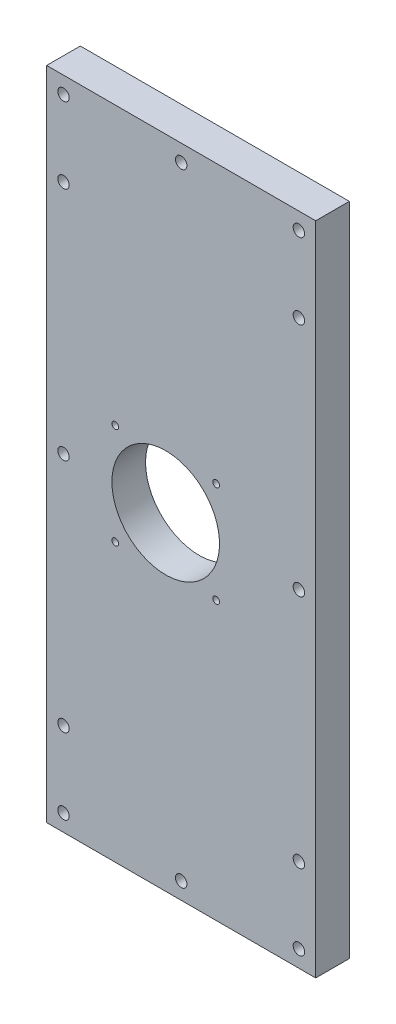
ISO-10303-21;
HEADER;
FILE_DESCRIPTION(('STEP AP214'),'2;1');
FILE_NAME('part.step','',(''),(''),'','','');
FILE_SCHEMA(('AUTOMOTIVE_DESIGN { 1 0 10303 214 1 1 1 1 }'));
ENDSEC;
DATA;
#1=APPLICATION_CONTEXT('core data for automotive mechanical design processes');
#2=APPLICATION_PROTOCOL_DEFINITION('international standard','automotive_design',2000,#1);
#3=PRODUCT_CONTEXT('',#1,'mechanical');
#4=PRODUCT('Part','Part','',(#3));
#5=PRODUCT_RELATED_PRODUCT_CATEGORY('part','',(#4));
#6=PRODUCT_DEFINITION_FORMATION('','',#4);
#7=PRODUCT_DEFINITION_CONTEXT('part definition',#1,'design');
#8=PRODUCT_DEFINITION('design','',#6,#7);
#9=PRODUCT_DEFINITION_SHAPE('','',#8);
#10=(LENGTH_UNIT() NAMED_UNIT(*) SI_UNIT(.MILLI.,.METRE.));
#11=(NAMED_UNIT(*) PLANE_ANGLE_UNIT() SI_UNIT($,.RADIAN.));
#12=(NAMED_UNIT(*) SI_UNIT($,.STERADIAN.) SOLID_ANGLE_UNIT());
#13=UNCERTAINTY_MEASURE_WITH_UNIT(LENGTH_MEASURE(1.E-05),#10,'distance_accuracy_value','');
#14=(GEOMETRIC_REPRESENTATION_CONTEXT(3) GLOBAL_UNCERTAINTY_ASSIGNED_CONTEXT((#13)) GLOBAL_UNIT_ASSIGNED_CONTEXT((#10,
#11,#12)) REPRESENTATION_CONTEXT('',''));
#15=CARTESIAN_POINT('',(0.,0.,0.));
#16=DIRECTION('',(0.,0.,1.));
#17=DIRECTION('',(1.,0.,0.));
#18=AXIS2_PLACEMENT_3D('',#15,#16,#17);
#19=CARTESIAN_POINT('',(-69.0593853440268,70.0995316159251,-10.));
#20=DIRECTION('',(-1.,0.,0.));
#21=DIRECTION('',(0.,0.,1.));
#22=AXIS2_PLACEMENT_3D('',#19,#20,#21);
#23=PLANE('',#22);
#24=DIRECTION('',(0.,-1.,0.));
#25=VECTOR('',#24,1.);
#26=CARTESIAN_POINT('',(-69.0593853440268,70.0995316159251,0.));
#27=LINE('',#26,#25);
#28=CARTESIAN_POINT('',(-69.0593853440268,70.0995316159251,0.));
#29=VERTEX_POINT('',#28);
#30=CARTESIAN_POINT('',(-69.0593853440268,-124.900468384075,0.));
#31=VERTEX_POINT('',#30);
#32=EDGE_CURVE('E98',#29,#31,#27,.T.);
#33=ORIENTED_EDGE('',*,*,#32,.F.);
#34=DIRECTION('',(0.,0.,1.));
#35=VECTOR('',#34,1.);
#36=CARTESIAN_POINT('',(-69.0593853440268,70.0995316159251,-10.));
#37=LINE('',#36,#35);
#38=CARTESIAN_POINT('',(-69.0593853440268,70.0995316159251,-10.));
#39=VERTEX_POINT('',#38);
#40=EDGE_CURVE('E11',#39,#29,#37,.T.);
#41=ORIENTED_EDGE('',*,*,#40,.F.);
#42=DIRECTION('',(0.,-1.,0.));
#43=VECTOR('',#42,1.);
#44=CARTESIAN_POINT('',(-69.0593853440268,70.0995316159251,-10.));
#45=LINE('',#44,#43);
#46=CARTESIAN_POINT('',(-69.0593853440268,-124.900468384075,-10.));
#47=VERTEX_POINT('',#46);
#48=EDGE_CURVE('E91',#39,#47,#45,.T.);
#49=ORIENTED_EDGE('',*,*,#48,.T.);
#50=DIRECTION('',(0.,0.,1.));
#51=VECTOR('',#50,1.);
#52=CARTESIAN_POINT('',(-69.0593853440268,-124.900468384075,-10.));
#53=LINE('',#52,#51);
#54=EDGE_CURVE('E36',#47,#31,#53,.T.);
#55=ORIENTED_EDGE('',*,*,#54,.T.);
#56=EDGE_LOOP('',(#33,#41,#49,#55));
#57=FACE_BOUND('',#56,.T.);
#58=ADVANCED_FACE('F33',(#57),#23,.T.);
#59=CARTESIAN_POINT('',(-69.0593853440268,70.0995316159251,-10.));
#60=DIRECTION('',(0.,1.,0.));
#61=DIRECTION('',(0.,0.,1.));
#62=AXIS2_PLACEMENT_3D('',#59,#60,#61);
#63=PLANE('',#62);
#64=DIRECTION('',(-1.,0.,0.));
#65=VECTOR('',#64,1.);
#66=CARTESIAN_POINT('',(-69.0593853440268,70.0995316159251,0.));
#67=LINE('',#66,#65);
#68=CARTESIAN_POINT('',(10.9406146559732,70.0995316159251,0.));
#69=VERTEX_POINT('',#68);
#70=EDGE_CURVE('E93',#69,#29,#67,.T.);
#71=ORIENTED_EDGE('',*,*,#70,.F.);
#72=DIRECTION('',(0.,0.,1.));
#73=VECTOR('',#72,1.);
#74=CARTESIAN_POINT('',(10.9406146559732,70.0995316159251,-10.));
#75=LINE('',#74,#73);
#76=CARTESIAN_POINT('',(10.9406146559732,70.0995316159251,-10.));
#77=VERTEX_POINT('',#76);
#78=EDGE_CURVE('E42',#77,#69,#75,.T.);
#79=ORIENTED_EDGE('',*,*,#78,.F.);
#80=DIRECTION('',(-1.,0.,0.));
#81=VECTOR('',#80,1.);
#82=CARTESIAN_POINT('',(-69.0593853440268,70.0995316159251,-10.));
#83=LINE('',#82,#81);
#84=EDGE_CURVE('E88',#77,#39,#83,.T.);
#85=ORIENTED_EDGE('',*,*,#84,.T.);
#86=ORIENTED_EDGE('',*,*,#40,.T.);
#87=EDGE_LOOP('',(#71,#79,#85,#86));
#88=FACE_BOUND('',#87,.T.);
#89=ADVANCED_FACE('F109',(#88),#63,.T.);
#90=CARTESIAN_POINT('',(10.9406146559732,70.0995316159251,-10.));
#91=DIRECTION('',(1.,0.,0.));
#92=DIRECTION('',(0.,1.,0.));
#93=AXIS2_PLACEMENT_3D('',#90,#91,#92);
#94=PLANE('',#93);
#95=DIRECTION('',(0.,1.,0.));
#96=VECTOR('',#95,1.);
#97=CARTESIAN_POINT('',(10.9406146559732,70.0995316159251,0.));
#98=LINE('',#97,#96);
#99=CARTESIAN_POINT('',(10.9406146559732,-124.900468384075,0.));
#100=VERTEX_POINT('',#99);
#101=EDGE_CURVE('E83',#100,#69,#98,.T.);
#102=ORIENTED_EDGE('',*,*,#101,.F.);
#103=DIRECTION('',(0.,0.,1.));
#104=VECTOR('',#103,1.);
#105=CARTESIAN_POINT('',(10.9406146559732,-124.900468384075,-10.));
#106=LINE('',#105,#104);
#107=CARTESIAN_POINT('',(10.9406146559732,-124.900468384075,-10.));
#108=VERTEX_POINT('',#107);
#109=EDGE_CURVE('E78',#108,#100,#106,.T.);
#110=ORIENTED_EDGE('',*,*,#109,.F.);
#111=DIRECTION('',(0.,1.,0.));
#112=VECTOR('',#111,1.);
#113=CARTESIAN_POINT('',(10.9406146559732,70.0995316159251,-10.));
#114=LINE('',#113,#112);
#115=EDGE_CURVE('E81',#108,#77,#114,.T.);
#116=ORIENTED_EDGE('',*,*,#115,.T.);
#117=ORIENTED_EDGE('',*,*,#78,.T.);
#118=EDGE_LOOP('',(#102,#110,#116,#117));
#119=FACE_BOUND('',#118,.T.);
#120=ADVANCED_FACE('F80',(#119),#94,.T.);
#121=CARTESIAN_POINT('',(-69.0593853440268,-124.900468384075,-10.));
#122=DIRECTION('',(0.,-1.,0.));
#123=DIRECTION('',(1.,0.,0.));
#124=AXIS2_PLACEMENT_3D('',#121,#122,#123);
#125=PLANE('',#124);
#126=DIRECTION('',(1.,0.,0.));
#127=VECTOR('',#126,1.);
#128=CARTESIAN_POINT('',(-69.0593853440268,-124.900468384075,0.));
#129=LINE('',#128,#127);
#130=EDGE_CURVE('E101',#31,#100,#129,.T.);
#131=ORIENTED_EDGE('',*,*,#130,.F.);
#132=ORIENTED_EDGE('',*,*,#54,.F.);
#133=DIRECTION('',(1.,0.,0.));
#134=VECTOR('',#133,1.);
#135=CARTESIAN_POINT('',(-69.0593853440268,-124.900468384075,-10.));
#136=LINE('',#135,#134);
#137=EDGE_CURVE('E87',#47,#108,#136,.T.);
#138=ORIENTED_EDGE('',*,*,#137,.T.);
#139=ORIENTED_EDGE('',*,*,#109,.T.);
#140=EDGE_LOOP('',(#131,#132,#138,#139));
#141=FACE_BOUND('',#140,.T.);
#142=ADVANCED_FACE('F90',(#141),#125,.T.);
#143=CARTESIAN_POINT('',(0.,0.,-10.));
#144=DIRECTION('',(0.,0.,1.));
#145=DIRECTION('',(1.,0.,0.));
#146=AXIS2_PLACEMENT_3D('',#143,#144,#145);
#147=PLANE('',#146);
#148=CARTESIAN_POINT('',(-64.0593853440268,-119.900468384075,-10.));
#149=DIRECTION('',(0.,0.,-1.));
#150=DIRECTION('',(-1.,0.,0.));
#151=AXIS2_PLACEMENT_3D('',#148,#149,#150);
#152=CIRCLE('',#151,3.50000000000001);
#153=CARTESIAN_POINT('',(-67.5593853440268,-119.900468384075,-10.));
#154=VERTEX_POINT('',#153);
#155=EDGE_CURVE('E408',#154,#154,#152,.T.);
#156=ORIENTED_EDGE('',*,*,#155,.F.);
#157=EDGE_LOOP('',(#156));
#158=FACE_BOUND('',#157,.T.);
#159=CARTESIAN_POINT('',(5.94061465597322,-97.400468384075,-10.));
#160=DIRECTION('',(0.,0.,-1.));
#161=DIRECTION('',(-1.,0.,0.));
#162=AXIS2_PLACEMENT_3D('',#159,#160,#161);
#163=CIRCLE('',#162,3.5);
#164=CARTESIAN_POINT('',(2.44061465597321,-97.400468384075,-10.));
#165=VERTEX_POINT('',#164);
#166=EDGE_CURVE('E395',#165,#165,#163,.T.);
#167=ORIENTED_EDGE('',*,*,#166,.F.);
#168=EDGE_LOOP('',(#167));
#169=FACE_BOUND('',#168,.T.);
#170=CARTESIAN_POINT('',(5.94061465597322,42.5995316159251,-10.));
#171=DIRECTION('',(0.,0.,-1.));
#172=DIRECTION('',(-1.,0.,0.));
#173=AXIS2_PLACEMENT_3D('',#170,#171,#172);
#174=CIRCLE('',#173,3.5);
#175=CARTESIAN_POINT('',(2.44061465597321,42.5995316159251,-10.));
#176=VERTEX_POINT('',#175);
#177=EDGE_CURVE('E396',#176,#176,#174,.T.);
#178=ORIENTED_EDGE('',*,*,#177,.F.);
#179=EDGE_LOOP('',(#178));
#180=FACE_BOUND('',#179,.T.);
#181=CARTESIAN_POINT('',(-64.0593853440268,-97.400468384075,-10.));
#182=DIRECTION('',(0.,0.,-1.));
#183=DIRECTION('',(-1.,0.,0.));
#184=AXIS2_PLACEMENT_3D('',#181,#182,#183);
#185=CIRCLE('',#184,3.50000000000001);
#186=CARTESIAN_POINT('',(-67.5593853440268,-97.400468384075,-10.));
#187=VERTEX_POINT('',#186);
#188=EDGE_CURVE('E377',#187,#187,#185,.T.);
#189=ORIENTED_EDGE('',*,*,#188,.F.);
#190=EDGE_LOOP('',(#189));
#191=FACE_BOUND('',#190,.T.);
#192=CARTESIAN_POINT('',(-29.0593853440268,65.099531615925,-10.));
#193=DIRECTION('',(0.,0.,-1.));
#194=DIRECTION('',(-1.,0.,0.));
#195=AXIS2_PLACEMENT_3D('',#192,#193,#194);
#196=CIRCLE('',#195,3.5);
#197=CARTESIAN_POINT('',(-32.5593853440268,65.099531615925,-10.));
#198=VERTEX_POINT('',#197);
#199=EDGE_CURVE('E432',#198,#198,#196,.T.);
#200=ORIENTED_EDGE('',*,*,#199,.F.);
#201=EDGE_LOOP('',(#200));
#202=FACE_BOUND('',#201,.T.);
#203=CARTESIAN_POINT('',(5.94061465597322,65.099531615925,-10.));
#204=DIRECTION('',(0.,0.,-1.));
#205=DIRECTION('',(-1.,0.,0.));
#206=AXIS2_PLACEMENT_3D('',#203,#204,#205);
#207=CIRCLE('',#206,3.5);
#208=CARTESIAN_POINT('',(2.44061465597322,65.099531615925,-10.));
#209=VERTEX_POINT('',#208);
#210=EDGE_CURVE('E419',#209,#209,#207,.T.);
#211=ORIENTED_EDGE('',*,*,#210,.F.);
#212=EDGE_LOOP('',(#211));
#213=FACE_BOUND('',#212,.T.);
#214=CARTESIAN_POINT('',(-64.0593853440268,65.099531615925,-10.));
#215=DIRECTION('',(0.,0.,-1.));
#216=DIRECTION('',(-1.,0.,0.));
#217=AXIS2_PLACEMENT_3D('',#214,#215,#216);
#218=CIRCLE('',#217,3.50000000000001);
#219=CARTESIAN_POINT('',(-67.5593853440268,65.099531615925,-10.));
#220=VERTEX_POINT('',#219);
#221=EDGE_CURVE('E420',#220,#220,#218,.T.);
#222=ORIENTED_EDGE('',*,*,#221,.F.);
#223=EDGE_LOOP('',(#222));
#224=FACE_BOUND('',#223,.T.);
#225=CARTESIAN_POINT('',(5.94061465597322,-119.900468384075,-10.));
#226=DIRECTION('',(0.,0.,-1.));
#227=DIRECTION('',(-1.,0.,0.));
#228=AXIS2_PLACEMENT_3D('',#225,#226,#227);
#229=CIRCLE('',#228,3.5);
#230=CARTESIAN_POINT('',(2.44061465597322,-119.900468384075,-10.));
#231=VERTEX_POINT('',#230);
#232=EDGE_CURVE('E407',#231,#231,#229,.T.);
#233=ORIENTED_EDGE('',*,*,#232,.F.);
#234=EDGE_LOOP('',(#233));
#235=FACE_BOUND('',#234,.T.);
#236=CARTESIAN_POINT('',(5.94061465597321,-27.4004683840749,-10.));
#237=DIRECTION('',(0.,0.,-1.));
#238=DIRECTION('',(-1.,0.,0.));
#239=AXIS2_PLACEMENT_3D('',#236,#237,#238);
#240=CIRCLE('',#239,3.5);
#241=CARTESIAN_POINT('',(2.44061465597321,-27.4004683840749,-10.));
#242=VERTEX_POINT('',#241);
#243=EDGE_CURVE('E378',#242,#242,#240,.T.);
#244=ORIENTED_EDGE('',*,*,#243,.F.);
#245=EDGE_LOOP('',(#244));
#246=FACE_BOUND('',#245,.T.);
#247=CARTESIAN_POINT('',(-64.0593853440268,-27.4004683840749,-10.));
#248=DIRECTION('',(0.,0.,-1.));
#249=DIRECTION('',(-1.,0.,0.));
#250=AXIS2_PLACEMENT_3D('',#247,#248,#249);
#251=CIRCLE('',#250,3.50000000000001);
#252=CARTESIAN_POINT('',(-67.5593853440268,-27.4004683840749,-10.));
#253=VERTEX_POINT('',#252);
#254=EDGE_CURVE('E384',#253,#253,#251,.T.);
#255=ORIENTED_EDGE('',*,*,#254,.F.);
#256=EDGE_LOOP('',(#255));
#257=FACE_BOUND('',#256,.T.);
#258=CARTESIAN_POINT('',(-64.0593853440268,42.5995316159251,-10.));
#259=DIRECTION('',(0.,0.,-1.));
#260=DIRECTION('',(-1.,0.,0.));
#261=AXIS2_PLACEMENT_3D('',#258,#259,#260);
#262=CIRCLE('',#261,3.50000000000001);
#263=CARTESIAN_POINT('',(-67.5593853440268,42.5995316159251,-10.));
#264=VERTEX_POINT('',#263);
#265=EDGE_CURVE('E371',#264,#264,#262,.T.);
#266=ORIENTED_EDGE('',*,*,#265,.F.);
#267=EDGE_LOOP('',(#266));
#268=FACE_BOUND('',#267,.T.);
#269=CARTESIAN_POINT('',(-29.0593853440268,-119.900468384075,-10.));
#270=DIRECTION('',(0.,0.,-1.));
#271=DIRECTION('',(-1.,0.,0.));
#272=AXIS2_PLACEMENT_3D('',#269,#270,#271);
#273=CIRCLE('',#272,3.5);
#274=CARTESIAN_POINT('',(-32.5593853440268,-119.900468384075,-10.));
#275=VERTEX_POINT('',#274);
#276=EDGE_CURVE('E431',#275,#275,#273,.T.);
#277=ORIENTED_EDGE('',*,*,#276,.F.);
#278=EDGE_LOOP('',(#277));
#279=FACE_BOUND('',#278,.T.);
#280=CARTESIAN_POINT('',(-48.6593853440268,-12.4004683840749,-10.));
#281=DIRECTION('',(0.,0.,-1.));
#282=DIRECTION('',(-1.,0.,0.));
#283=AXIS2_PLACEMENT_3D('',#280,#281,#282);
#284=CIRCLE('',#283,0.999999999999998);
#285=CARTESIAN_POINT('',(-49.6593853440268,-12.4004683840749,-10.));
#286=VERTEX_POINT('',#285);
#287=EDGE_CURVE('E462',#286,#286,#284,.T.);
#288=ORIENTED_EDGE('',*,*,#287,.F.);
#289=EDGE_LOOP('',(#288));
#290=FACE_BOUND('',#289,.T.);
#291=CARTESIAN_POINT('',(-18.6593853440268,-42.4004683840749,-10.));
#292=DIRECTION('',(0.,0.,-1.));
#293=DIRECTION('',(-1.,0.,0.));
#294=AXIS2_PLACEMENT_3D('',#291,#292,#293);
#295=CIRCLE('',#294,1.);
#296=CARTESIAN_POINT('',(-19.6593853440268,-42.4004683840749,-10.));
#297=VERTEX_POINT('',#296);
#298=EDGE_CURVE('E455',#297,#297,#295,.T.);
#299=ORIENTED_EDGE('',*,*,#298,.F.);
#300=EDGE_LOOP('',(#299));
#301=FACE_BOUND('',#300,.T.);
#302=CARTESIAN_POINT('',(-33.6593853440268,-27.4004683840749,-10.));
#303=DIRECTION('',(0.,0.,-1.));
#304=DIRECTION('',(-1.,0.,0.));
#305=AXIS2_PLACEMENT_3D('',#302,#303,#304);
#306=CIRCLE('',#305,16.);
#307=CARTESIAN_POINT('',(-49.6593853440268,-27.4004683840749,-10.));
#308=VERTEX_POINT('',#307);
#309=EDGE_CURVE('E443',#308,#308,#306,.T.);
#310=ORIENTED_EDGE('',*,*,#309,.F.);
#311=EDGE_LOOP('',(#310));
#312=FACE_BOUND('',#311,.T.);
#313=CARTESIAN_POINT('',(-48.6593853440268,-42.4004683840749,-10.));
#314=DIRECTION('',(0.,0.,-1.));
#315=DIRECTION('',(-1.,0.,0.));
#316=AXIS2_PLACEMENT_3D('',#313,#314,#315);
#317=CIRCLE('',#316,0.999999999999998);
#318=CARTESIAN_POINT('',(-49.6593853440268,-42.4004683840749,-10.));
#319=VERTEX_POINT('',#318);
#320=EDGE_CURVE('E449',#319,#319,#317,.T.);
#321=ORIENTED_EDGE('',*,*,#320,.F.);
#322=EDGE_LOOP('',(#321));
#323=FACE_BOUND('',#322,.T.);
#324=CARTESIAN_POINT('',(-18.6593853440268,-12.4004683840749,-10.));
#325=DIRECTION('',(0.,0.,-1.));
#326=DIRECTION('',(-1.,0.,0.));
#327=AXIS2_PLACEMENT_3D('',#324,#325,#326);
#328=CIRCLE('',#327,1.);
#329=CARTESIAN_POINT('',(-19.6593853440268,-12.4004683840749,-10.));
#330=VERTEX_POINT('',#329);
#331=EDGE_CURVE('E461',#330,#330,#328,.T.);
#332=ORIENTED_EDGE('',*,*,#331,.F.);
#333=EDGE_LOOP('',(#332));
#334=FACE_BOUND('',#333,.T.);
#335=ORIENTED_EDGE('',*,*,#48,.F.);
#336=ORIENTED_EDGE('',*,*,#84,.F.);
#337=ORIENTED_EDGE('',*,*,#115,.F.);
#338=ORIENTED_EDGE('',*,*,#137,.F.);
#339=EDGE_LOOP('',(#335,#336,#337,#338));
#340=FACE_BOUND('',#339,.T.);
#341=ADVANCED_FACE('F86',(#158,#169,#180,#191,#202,#213,#224,#235,#246,#257,#268,#279,#290,#301,
#312,#323,#334,#340),#147,.F.);
#342=CARTESIAN_POINT('',(0.,0.,0.));
#343=DIRECTION('',(0.,0.,1.));
#344=DIRECTION('',(1.,0.,0.));
#345=AXIS2_PLACEMENT_3D('',#342,#343,#344);
#346=PLANE('',#345);
#347=CARTESIAN_POINT('',(5.9406146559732,-119.900468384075,0.));
#348=DIRECTION('',(0.,0.,1.));
#349=DIRECTION('',(1.,0.,0.));
#350=AXIS2_PLACEMENT_3D('',#347,#348,#349);
#351=CIRCLE('',#350,1.7);
#352=CARTESIAN_POINT('',(7.6406146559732,-119.900468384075,0.));
#353=VERTEX_POINT('',#352);
#354=EDGE_CURVE('E306',#353,#353,#351,.T.);
#355=ORIENTED_EDGE('',*,*,#354,.F.);
#356=EDGE_LOOP('',(#355));
#357=FACE_BOUND('',#356,.T.);
#358=CARTESIAN_POINT('',(-64.0593853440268,-119.900468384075,0.));
#359=DIRECTION('',(0.,0.,1.));
#360=DIRECTION('',(1.,0.,0.));
#361=AXIS2_PLACEMENT_3D('',#358,#359,#360);
#362=CIRCLE('',#361,1.7);
#363=CARTESIAN_POINT('',(-62.3593853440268,-119.900468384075,0.));
#364=VERTEX_POINT('',#363);
#365=EDGE_CURVE('E336',#364,#364,#362,.T.);
#366=ORIENTED_EDGE('',*,*,#365,.F.);
#367=EDGE_LOOP('',(#366));
#368=FACE_BOUND('',#367,.T.);
#369=CARTESIAN_POINT('',(-64.0593853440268,-97.400468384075,0.));
#370=DIRECTION('',(0.,0.,1.));
#371=DIRECTION('',(1.,0.,0.));
#372=AXIS2_PLACEMENT_3D('',#369,#370,#371);
#373=CIRCLE('',#372,1.7);
#374=CARTESIAN_POINT('',(-62.3593853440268,-97.400468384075,0.));
#375=VERTEX_POINT('',#374);
#376=EDGE_CURVE('E330',#375,#375,#373,.T.);
#377=ORIENTED_EDGE('',*,*,#376,.F.);
#378=EDGE_LOOP('',(#377));
#379=FACE_BOUND('',#378,.T.);
#380=CARTESIAN_POINT('',(-64.0593853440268,-27.4004683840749,0.));
#381=DIRECTION('',(0.,0.,1.));
#382=DIRECTION('',(1.,0.,0.));
#383=AXIS2_PLACEMENT_3D('',#380,#381,#382);
#384=CIRCLE('',#383,1.7);
#385=CARTESIAN_POINT('',(-62.3593853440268,-27.4004683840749,0.));
#386=VERTEX_POINT('',#385);
#387=EDGE_CURVE('E324',#386,#386,#384,.T.);
#388=ORIENTED_EDGE('',*,*,#387,.F.);
#389=EDGE_LOOP('',(#388));
#390=FACE_BOUND('',#389,.T.);
#391=CARTESIAN_POINT('',(-64.0593853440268,65.099531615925,0.));
#392=DIRECTION('',(0.,0.,1.));
#393=DIRECTION('',(1.,0.,0.));
#394=AXIS2_PLACEMENT_3D('',#391,#392,#393);
#395=CIRCLE('',#394,1.7);
#396=CARTESIAN_POINT('',(-62.3593853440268,65.099531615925,0.));
#397=VERTEX_POINT('',#396);
#398=EDGE_CURVE('E323',#397,#397,#395,.T.);
#399=ORIENTED_EDGE('',*,*,#398,.F.);
#400=EDGE_LOOP('',(#399));
#401=FACE_BOUND('',#400,.T.);
#402=CARTESIAN_POINT('',(5.94061465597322,65.099531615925,0.));
#403=DIRECTION('',(0.,0.,1.));
#404=DIRECTION('',(1.,0.,0.));
#405=AXIS2_PLACEMENT_3D('',#402,#403,#404);
#406=CIRCLE('',#405,1.7);
#407=CARTESIAN_POINT('',(7.64061465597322,65.099531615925,0.));
#408=VERTEX_POINT('',#407);
#409=EDGE_CURVE('E360',#408,#408,#406,.T.);
#410=ORIENTED_EDGE('',*,*,#409,.F.);
#411=EDGE_LOOP('',(#410));
#412=FACE_BOUND('',#411,.T.);
#413=CARTESIAN_POINT('',(-29.0593853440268,-119.900468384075,0.));
#414=DIRECTION('',(0.,0.,1.));
#415=DIRECTION('',(1.,0.,0.));
#416=AXIS2_PLACEMENT_3D('',#413,#414,#415);
#417=CIRCLE('',#416,1.7);
#418=CARTESIAN_POINT('',(-27.3593853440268,-119.900468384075,0.));
#419=VERTEX_POINT('',#418);
#420=EDGE_CURVE('E354',#419,#419,#417,.T.);
#421=ORIENTED_EDGE('',*,*,#420,.F.);
#422=EDGE_LOOP('',(#421));
#423=FACE_BOUND('',#422,.T.);
#424=CARTESIAN_POINT('',(-64.0593853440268,42.5995316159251,0.));
#425=DIRECTION('',(0.,0.,1.));
#426=DIRECTION('',(1.,0.,0.));
#427=AXIS2_PLACEMENT_3D('',#424,#425,#426);
#428=CIRCLE('',#427,1.7);
#429=CARTESIAN_POINT('',(-62.3593853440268,42.5995316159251,0.));
#430=VERTEX_POINT('',#429);
#431=EDGE_CURVE('E348',#430,#430,#428,.T.);
#432=ORIENTED_EDGE('',*,*,#431,.F.);
#433=EDGE_LOOP('',(#432));
#434=FACE_BOUND('',#433,.T.);
#435=CARTESIAN_POINT('',(5.94061465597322,-97.400468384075,0.));
#436=DIRECTION('',(0.,0.,1.));
#437=DIRECTION('',(1.,0.,0.));
#438=AXIS2_PLACEMENT_3D('',#435,#436,#437);
#439=CIRCLE('',#438,1.7);
#440=CARTESIAN_POINT('',(7.64061465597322,-97.400468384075,0.));
#441=VERTEX_POINT('',#440);
#442=EDGE_CURVE('E302',#441,#441,#439,.T.);
#443=ORIENTED_EDGE('',*,*,#442,.F.);
#444=EDGE_LOOP('',(#443));
#445=FACE_BOUND('',#444,.T.);
#446=CARTESIAN_POINT('',(5.9406146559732,-27.4004683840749,0.));
#447=DIRECTION('',(0.,0.,1.));
#448=DIRECTION('',(1.,0.,0.));
#449=AXIS2_PLACEMENT_3D('',#446,#447,#448);
#450=CIRCLE('',#449,1.7);
#451=CARTESIAN_POINT('',(7.6406146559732,-27.4004683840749,0.));
#452=VERTEX_POINT('',#451);
#453=EDGE_CURVE('E309',#452,#452,#450,.T.);
#454=ORIENTED_EDGE('',*,*,#453,.F.);
#455=EDGE_LOOP('',(#454));
#456=FACE_BOUND('',#455,.T.);
#457=CARTESIAN_POINT('',(5.94061465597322,42.5995316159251,0.));
#458=DIRECTION('',(0.,0.,1.));
#459=DIRECTION('',(1.,0.,0.));
#460=AXIS2_PLACEMENT_3D('',#457,#458,#459);
#461=CIRCLE('',#460,1.7);
#462=CARTESIAN_POINT('',(7.64061465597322,42.5995316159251,0.));
#463=VERTEX_POINT('',#462);
#464=EDGE_CURVE('E317',#463,#463,#461,.T.);
#465=ORIENTED_EDGE('',*,*,#464,.F.);
#466=EDGE_LOOP('',(#465));
#467=FACE_BOUND('',#466,.T.);
#468=CARTESIAN_POINT('',(-29.0593853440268,65.099531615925,0.));
#469=DIRECTION('',(0.,0.,1.));
#470=DIRECTION('',(1.,0.,0.));
#471=AXIS2_PLACEMENT_3D('',#468,#469,#470);
#472=CIRCLE('',#471,1.7);
#473=CARTESIAN_POINT('',(-27.3593853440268,65.099531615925,0.));
#474=VERTEX_POINT('',#473);
#475=EDGE_CURVE('E347',#474,#474,#472,.T.);
#476=ORIENTED_EDGE('',*,*,#475,.F.);
#477=EDGE_LOOP('',(#476));
#478=FACE_BOUND('',#477,.T.);
#479=CARTESIAN_POINT('',(-48.6593853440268,-12.4004683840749,0.));
#480=DIRECTION('',(0.,0.,-1.));
#481=DIRECTION('',(-1.,0.,0.));
#482=AXIS2_PLACEMENT_3D('',#479,#480,#481);
#483=CIRCLE('',#482,0.999999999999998);
#484=CARTESIAN_POINT('',(-49.6593853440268,-12.4004683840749,0.));
#485=VERTEX_POINT('',#484);
#486=EDGE_CURVE('E458',#485,#485,#483,.T.);
#487=ORIENTED_EDGE('',*,*,#486,.T.);
#488=EDGE_LOOP('',(#487));
#489=FACE_BOUND('',#488,.T.);
#490=CARTESIAN_POINT('',(-18.6593853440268,-42.4004683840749,0.));
#491=DIRECTION('',(0.,0.,-1.));
#492=DIRECTION('',(-1.,0.,0.));
#493=AXIS2_PLACEMENT_3D('',#490,#491,#492);
#494=CIRCLE('',#493,1.);
#495=CARTESIAN_POINT('',(-19.6593853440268,-42.4004683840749,0.));
#496=VERTEX_POINT('',#495);
#497=EDGE_CURVE('E465',#496,#496,#494,.T.);
#498=ORIENTED_EDGE('',*,*,#497,.T.);
#499=EDGE_LOOP('',(#498));
#500=FACE_BOUND('',#499,.T.);
#501=CARTESIAN_POINT('',(-33.6593853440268,-27.4004683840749,0.));
#502=DIRECTION('',(0.,0.,-1.));
#503=DIRECTION('',(-1.,0.,0.));
#504=AXIS2_PLACEMENT_3D('',#501,#502,#503);
#505=CIRCLE('',#504,16.);
#506=CARTESIAN_POINT('',(-49.6593853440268,-27.4004683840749,0.));
#507=VERTEX_POINT('',#506);
#508=EDGE_CURVE('E446',#507,#507,#505,.T.);
#509=ORIENTED_EDGE('',*,*,#508,.T.);
#510=EDGE_LOOP('',(#509));
#511=FACE_BOUND('',#510,.T.);
#512=CARTESIAN_POINT('',(-48.6593853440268,-42.4004683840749,0.));
#513=DIRECTION('',(0.,0.,-1.));
#514=DIRECTION('',(-1.,0.,0.));
#515=AXIS2_PLACEMENT_3D('',#512,#513,#514);
#516=CIRCLE('',#515,0.999999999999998);
#517=CARTESIAN_POINT('',(-49.6593853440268,-42.4004683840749,0.));
#518=VERTEX_POINT('',#517);
#519=EDGE_CURVE('E452',#518,#518,#516,.T.);
#520=ORIENTED_EDGE('',*,*,#519,.T.);
#521=EDGE_LOOP('',(#520));
#522=FACE_BOUND('',#521,.T.);
#523=CARTESIAN_POINT('',(-18.6593853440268,-12.4004683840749,0.));
#524=DIRECTION('',(0.,0.,-1.));
#525=DIRECTION('',(-1.,0.,0.));
#526=AXIS2_PLACEMENT_3D('',#523,#524,#525);
#527=CIRCLE('',#526,1.);
#528=CARTESIAN_POINT('',(-19.6593853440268,-12.4004683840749,0.));
#529=VERTEX_POINT('',#528);
#530=EDGE_CURVE('E102',#529,#529,#527,.T.);
#531=ORIENTED_EDGE('',*,*,#530,.T.);
#532=EDGE_LOOP('',(#531));
#533=FACE_BOUND('',#532,.T.);
#534=ORIENTED_EDGE('',*,*,#32,.T.);
#535=ORIENTED_EDGE('',*,*,#130,.T.);
#536=ORIENTED_EDGE('',*,*,#101,.T.);
#537=ORIENTED_EDGE('',*,*,#70,.T.);
#538=EDGE_LOOP('',(#534,#535,#536,#537));
#539=FACE_BOUND('',#538,.T.);
#540=ADVANCED_FACE('F108',(#357,#368,#379,#390,#401,#412,#423,#434,#445,#456,#467,#478,#489,
#500,#511,#522,#533,#539),#346,.T.);
#541=CARTESIAN_POINT('',(-18.6593853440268,-12.4004683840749,0.));
#542=DIRECTION('',(0.,0.,-1.));
#543=DIRECTION('',(-1.,0.,0.));
#544=AXIS2_PLACEMENT_3D('',#541,#542,#543);
#545=CYLINDRICAL_SURFACE('',#544,1.);
#546=ORIENTED_EDGE('',*,*,#530,.F.);
#547=EDGE_LOOP('',(#546));
#548=FACE_BOUND('',#547,.T.);
#549=ORIENTED_EDGE('',*,*,#331,.T.);
#550=EDGE_LOOP('',(#549));
#551=FACE_BOUND('',#550,.T.);
#552=ADVANCED_FACE('F127',(#548,#551),#545,.F.);
#553=CARTESIAN_POINT('',(-48.6593853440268,-42.4004683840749,0.));
#554=DIRECTION('',(0.,0.,-1.));
#555=DIRECTION('',(-1.,0.,0.));
#556=AXIS2_PLACEMENT_3D('',#553,#554,#555);
#557=CYLINDRICAL_SURFACE('',#556,0.999999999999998);
#558=ORIENTED_EDGE('',*,*,#519,.F.);
#559=EDGE_LOOP('',(#558));
#560=FACE_BOUND('',#559,.T.);
#561=ORIENTED_EDGE('',*,*,#320,.T.);
#562=EDGE_LOOP('',(#561));
#563=FACE_BOUND('',#562,.T.);
#564=ADVANCED_FACE('F134',(#560,#563),#557,.F.);
#565=CARTESIAN_POINT('',(-33.6593853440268,-27.4004683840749,0.));
#566=DIRECTION('',(0.,0.,-1.));
#567=DIRECTION('',(-1.,0.,0.));
#568=AXIS2_PLACEMENT_3D('',#565,#566,#567);
#569=CYLINDRICAL_SURFACE('',#568,16.);
#570=ORIENTED_EDGE('',*,*,#508,.F.);
#571=EDGE_LOOP('',(#570));
#572=FACE_BOUND('',#571,.T.);
#573=ORIENTED_EDGE('',*,*,#309,.T.);
#574=EDGE_LOOP('',(#573));
#575=FACE_BOUND('',#574,.T.);
#576=ADVANCED_FACE('F140',(#572,#575),#569,.F.);
#577=CARTESIAN_POINT('',(-18.6593853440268,-42.4004683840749,0.));
#578=DIRECTION('',(0.,0.,-1.));
#579=DIRECTION('',(-1.,0.,0.));
#580=AXIS2_PLACEMENT_3D('',#577,#578,#579);
#581=CYLINDRICAL_SURFACE('',#580,1.);
#582=ORIENTED_EDGE('',*,*,#497,.F.);
#583=EDGE_LOOP('',(#582));
#584=FACE_BOUND('',#583,.T.);
#585=ORIENTED_EDGE('',*,*,#298,.T.);
#586=EDGE_LOOP('',(#585));
#587=FACE_BOUND('',#586,.T.);
#588=ADVANCED_FACE('F136',(#584,#587),#581,.F.);
#589=CARTESIAN_POINT('',(-48.6593853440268,-12.4004683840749,0.));
#590=DIRECTION('',(0.,0.,-1.));
#591=DIRECTION('',(-1.,0.,0.));
#592=AXIS2_PLACEMENT_3D('',#589,#590,#591);
#593=CYLINDRICAL_SURFACE('',#592,0.999999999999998);
#594=ORIENTED_EDGE('',*,*,#486,.F.);
#595=EDGE_LOOP('',(#594));
#596=FACE_BOUND('',#595,.T.);
#597=ORIENTED_EDGE('',*,*,#287,.T.);
#598=EDGE_LOOP('',(#597));
#599=FACE_BOUND('',#598,.T.);
#600=ADVANCED_FACE('F139',(#596,#599),#593,.F.);
#601=CARTESIAN_POINT('',(-29.0593853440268,-119.900468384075,-5.));
#602=DIRECTION('',(0.,0.,-1.));
#603=DIRECTION('',(-1.,0.,0.));
#604=AXIS2_PLACEMENT_3D('',#601,#602,#603);
#605=CYLINDRICAL_SURFACE('',#604,3.5);
#606=CARTESIAN_POINT('',(-29.0593853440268,-119.900468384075,-5.));
#607=DIRECTION('',(0.,0.,-1.));
#608=DIRECTION('',(-1.,0.,0.));
#609=AXIS2_PLACEMENT_3D('',#606,#607,#608);
#610=CIRCLE('',#609,3.5);
#611=CARTESIAN_POINT('',(-32.5593853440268,-119.900468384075,-5.));
#612=VERTEX_POINT('',#611);
#613=EDGE_CURVE('E440',#612,#612,#610,.T.);
#614=ORIENTED_EDGE('',*,*,#613,.F.);
#615=EDGE_LOOP('',(#614));
#616=FACE_BOUND('',#615,.T.);
#617=ORIENTED_EDGE('',*,*,#276,.T.);
#618=EDGE_LOOP('',(#617));
#619=FACE_BOUND('',#618,.T.);
#620=ADVANCED_FACE('F144',(#616,#619),#605,.F.);
#621=CARTESIAN_POINT('',(-29.0593853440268,-119.900468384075,-5.));
#622=DIRECTION('',(0.,0.,-1.));
#623=DIRECTION('',(-1.,0.,0.));
#624=AXIS2_PLACEMENT_3D('',#621,#622,#623);
#625=PLANE('',#624);
#626=CARTESIAN_POINT('',(-29.0593853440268,-119.900468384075,-5.));
#627=DIRECTION('',(0.,0.,1.));
#628=DIRECTION('',(1.,0.,0.));
#629=AXIS2_PLACEMENT_3D('',#626,#627,#628);
#630=CIRCLE('',#629,1.7);
#631=CARTESIAN_POINT('',(-27.3593853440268,-119.900468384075,-5.));
#632=VERTEX_POINT('',#631);
#633=EDGE_CURVE('E351',#632,#632,#630,.T.);
#634=ORIENTED_EDGE('',*,*,#633,.T.);
#635=EDGE_LOOP('',(#634));
#636=FACE_BOUND('',#635,.T.);
#637=ORIENTED_EDGE('',*,*,#613,.T.);
#638=EDGE_LOOP('',(#637));
#639=FACE_BOUND('',#638,.T.);
#640=ADVANCED_FACE('F154',(#636,#639),#625,.T.);
#641=CARTESIAN_POINT('',(-64.0593853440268,42.5995316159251,-5.));
#642=DIRECTION('',(0.,0.,-1.));
#643=DIRECTION('',(-1.,0.,0.));
#644=AXIS2_PLACEMENT_3D('',#641,#642,#643);
#645=CYLINDRICAL_SURFACE('',#644,3.50000000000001);
#646=CARTESIAN_POINT('',(-64.0593853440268,42.5995316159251,-5.));
#647=DIRECTION('',(0.,0.,-1.));
#648=DIRECTION('',(-1.,0.,0.));
#649=AXIS2_PLACEMENT_3D('',#646,#647,#648);
#650=CIRCLE('',#649,3.50000000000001);
#651=CARTESIAN_POINT('',(-67.5593853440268,42.5995316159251,-5.));
#652=VERTEX_POINT('',#651);
#653=EDGE_CURVE('E387',#652,#652,#650,.T.);
#654=ORIENTED_EDGE('',*,*,#653,.F.);
#655=EDGE_LOOP('',(#654));
#656=FACE_BOUND('',#655,.T.);
#657=ORIENTED_EDGE('',*,*,#265,.T.);
#658=EDGE_LOOP('',(#657));
#659=FACE_BOUND('',#658,.T.);
#660=ADVANCED_FACE('F158',(#656,#659),#645,.F.);
#661=CARTESIAN_POINT('',(-64.0593853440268,42.5995316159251,-5.));
#662=DIRECTION('',(0.,0.,-1.));
#663=DIRECTION('',(-1.,0.,0.));
#664=AXIS2_PLACEMENT_3D('',#661,#662,#663);
#665=PLANE('',#664);
#666=CARTESIAN_POINT('',(-64.0593853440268,42.5995316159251,-5.));
#667=DIRECTION('',(0.,0.,1.));
#668=DIRECTION('',(1.,0.,0.));
#669=AXIS2_PLACEMENT_3D('',#666,#667,#668);
#670=CIRCLE('',#669,1.7);
#671=CARTESIAN_POINT('',(-62.3593853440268,42.5995316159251,-5.));
#672=VERTEX_POINT('',#671);
#673=EDGE_CURVE('E344',#672,#672,#670,.T.);
#674=ORIENTED_EDGE('',*,*,#673,.T.);
#675=EDGE_LOOP('',(#674));
#676=FACE_BOUND('',#675,.T.);
#677=ORIENTED_EDGE('',*,*,#653,.T.);
#678=EDGE_LOOP('',(#677));
#679=FACE_BOUND('',#678,.T.);
#680=ADVANCED_FACE('F228',(#676,#679),#665,.T.);
#681=CARTESIAN_POINT('',(-64.0593853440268,-27.4004683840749,-5.));
#682=DIRECTION('',(0.,0.,-1.));
#683=DIRECTION('',(-1.,0.,0.));
#684=AXIS2_PLACEMENT_3D('',#681,#682,#683);
#685=CYLINDRICAL_SURFACE('',#684,3.50000000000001);
#686=CARTESIAN_POINT('',(-64.0593853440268,-27.4004683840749,-5.));
#687=DIRECTION('',(0.,0.,-1.));
#688=DIRECTION('',(-1.,0.,0.));
#689=AXIS2_PLACEMENT_3D('',#686,#687,#688);
#690=CIRCLE('',#689,3.50000000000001);
#691=CARTESIAN_POINT('',(-67.5593853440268,-27.4004683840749,-5.));
#692=VERTEX_POINT('',#691);
#693=EDGE_CURVE('E381',#692,#692,#690,.T.);
#694=ORIENTED_EDGE('',*,*,#693,.F.);
#695=EDGE_LOOP('',(#694));
#696=FACE_BOUND('',#695,.T.);
#697=ORIENTED_EDGE('',*,*,#254,.T.);
#698=EDGE_LOOP('',(#697));
#699=FACE_BOUND('',#698,.T.);
#700=ADVANCED_FACE('F232',(#696,#699),#685,.F.);
#701=CARTESIAN_POINT('',(-64.0593853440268,-27.4004683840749,-5.));
#702=DIRECTION('',(0.,0.,-1.));
#703=DIRECTION('',(-1.,0.,0.));
#704=AXIS2_PLACEMENT_3D('',#701,#702,#703);
#705=PLANE('',#704);
#706=CARTESIAN_POINT('',(-64.0593853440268,-27.4004683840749,-5.));
#707=DIRECTION('',(0.,0.,1.));
#708=DIRECTION('',(1.,0.,0.));
#709=AXIS2_PLACEMENT_3D('',#706,#707,#708);
#710=CIRCLE('',#709,1.7);
#711=CARTESIAN_POINT('',(-62.3593853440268,-27.4004683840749,-5.));
#712=VERTEX_POINT('',#711);
#713=EDGE_CURVE('E320',#712,#712,#710,.T.);
#714=ORIENTED_EDGE('',*,*,#713,.T.);
#715=EDGE_LOOP('',(#714));
#716=FACE_BOUND('',#715,.T.);
#717=ORIENTED_EDGE('',*,*,#693,.T.);
#718=EDGE_LOOP('',(#717));
#719=FACE_BOUND('',#718,.T.);
#720=ADVANCED_FACE('F236',(#716,#719),#705,.T.);
#721=CARTESIAN_POINT('',(5.94061465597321,-27.4004683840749,-5.));
#722=DIRECTION('',(0.,0.,-1.));
#723=DIRECTION('',(-1.,0.,0.));
#724=AXIS2_PLACEMENT_3D('',#721,#722,#723);
#725=CYLINDRICAL_SURFACE('',#724,3.5);
#726=CARTESIAN_POINT('',(5.94061465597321,-27.4004683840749,-5.));
#727=DIRECTION('',(0.,0.,-1.));
#728=DIRECTION('',(-1.,0.,0.));
#729=AXIS2_PLACEMENT_3D('',#726,#727,#728);
#730=CIRCLE('',#729,3.5);
#731=CARTESIAN_POINT('',(2.44061465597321,-27.4004683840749,-5.));
#732=VERTEX_POINT('',#731);
#733=EDGE_CURVE('E374',#732,#732,#730,.T.);
#734=ORIENTED_EDGE('',*,*,#733,.F.);
#735=EDGE_LOOP('',(#734));
#736=FACE_BOUND('',#735,.T.);
#737=ORIENTED_EDGE('',*,*,#243,.T.);
#738=EDGE_LOOP('',(#737));
#739=FACE_BOUND('',#738,.T.);
#740=ADVANCED_FACE('F240',(#736,#739),#725,.F.);
#741=CARTESIAN_POINT('',(5.94061465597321,-27.4004683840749,-5.));
#742=DIRECTION('',(0.,0.,-1.));
#743=DIRECTION('',(-1.,0.,0.));
#744=AXIS2_PLACEMENT_3D('',#741,#742,#743);
#745=PLANE('',#744);
#746=CARTESIAN_POINT('',(5.9406146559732,-27.4004683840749,-5.));
#747=DIRECTION('',(0.,0.,1.));
#748=DIRECTION('',(1.,0.,0.));
#749=AXIS2_PLACEMENT_3D('',#746,#747,#748);
#750=CIRCLE('',#749,1.7);
#751=CARTESIAN_POINT('',(7.6406146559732,-27.4004683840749,-5.));
#752=VERTEX_POINT('',#751);
#753=EDGE_CURVE('E304',#752,#752,#750,.T.);
#754=ORIENTED_EDGE('',*,*,#753,.T.);
#755=EDGE_LOOP('',(#754));
#756=FACE_BOUND('',#755,.T.);
#757=ORIENTED_EDGE('',*,*,#733,.T.);
#758=EDGE_LOOP('',(#757));
#759=FACE_BOUND('',#758,.T.);
#760=ADVANCED_FACE('F182',(#756,#759),#745,.T.);
#761=CARTESIAN_POINT('',(5.94061465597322,-119.900468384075,-5.));
#762=DIRECTION('',(0.,0.,-1.));
#763=DIRECTION('',(-1.,0.,0.));
#764=AXIS2_PLACEMENT_3D('',#761,#762,#763);
#765=CYLINDRICAL_SURFACE('',#764,3.5);
#766=CARTESIAN_POINT('',(5.94061465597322,-119.900468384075,-5.));
#767=DIRECTION('',(0.,0.,-1.));
#768=DIRECTION('',(-1.,0.,0.));
#769=AXIS2_PLACEMENT_3D('',#766,#767,#768);
#770=CIRCLE('',#769,3.5);
#771=CARTESIAN_POINT('',(2.44061465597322,-119.900468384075,-5.));
#772=VERTEX_POINT('',#771);
#773=EDGE_CURVE('E423',#772,#772,#770,.T.);
#774=ORIENTED_EDGE('',*,*,#773,.F.);
#775=EDGE_LOOP('',(#774));
#776=FACE_BOUND('',#775,.T.);
#777=ORIENTED_EDGE('',*,*,#232,.T.);
#778=EDGE_LOOP('',(#777));
#779=FACE_BOUND('',#778,.T.);
#780=ADVANCED_FACE('F178',(#776,#779),#765,.F.);
#781=CARTESIAN_POINT('',(5.94061465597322,-119.900468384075,-5.));
#782=DIRECTION('',(0.,0.,-1.));
#783=DIRECTION('',(-1.,0.,0.));
#784=AXIS2_PLACEMENT_3D('',#781,#782,#783);
#785=PLANE('',#784);
#786=CARTESIAN_POINT('',(5.9406146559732,-119.900468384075,-5.));
#787=DIRECTION('',(0.,0.,1.));
#788=DIRECTION('',(1.,0.,0.));
#789=AXIS2_PLACEMENT_3D('',#786,#787,#788);
#790=CIRCLE('',#789,1.7);
#791=CARTESIAN_POINT('',(7.6406146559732,-119.900468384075,-5.));
#792=VERTEX_POINT('',#791);
#793=EDGE_CURVE('E339',#792,#792,#790,.T.);
#794=ORIENTED_EDGE('',*,*,#793,.T.);
#795=EDGE_LOOP('',(#794));
#796=FACE_BOUND('',#795,.T.);
#797=ORIENTED_EDGE('',*,*,#773,.T.);
#798=EDGE_LOOP('',(#797));
#799=FACE_BOUND('',#798,.T.);
#800=ADVANCED_FACE('F181',(#796,#799),#785,.T.);
#801=CARTESIAN_POINT('',(-64.0593853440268,65.099531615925,-5.));
#802=DIRECTION('',(0.,0.,-1.));
#803=DIRECTION('',(-1.,0.,0.));
#804=AXIS2_PLACEMENT_3D('',#801,#802,#803);
#805=CYLINDRICAL_SURFACE('',#804,3.50000000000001);
#806=CARTESIAN_POINT('',(-64.0593853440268,65.099531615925,-5.));
#807=DIRECTION('',(0.,0.,-1.));
#808=DIRECTION('',(-1.,0.,0.));
#809=AXIS2_PLACEMENT_3D('',#806,#807,#808);
#810=CIRCLE('',#809,3.50000000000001);
#811=CARTESIAN_POINT('',(-67.5593853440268,65.099531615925,-5.));
#812=VERTEX_POINT('',#811);
#813=EDGE_CURVE('E416',#812,#812,#810,.T.);
#814=ORIENTED_EDGE('',*,*,#813,.F.);
#815=EDGE_LOOP('',(#814));
#816=FACE_BOUND('',#815,.T.);
#817=ORIENTED_EDGE('',*,*,#221,.T.);
#818=EDGE_LOOP('',(#817));
#819=FACE_BOUND('',#818,.T.);
#820=ADVANCED_FACE('F186',(#816,#819),#805,.F.);
#821=CARTESIAN_POINT('',(-64.0593853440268,65.099531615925,-5.));
#822=DIRECTION('',(0.,0.,-1.));
#823=DIRECTION('',(-1.,0.,0.));
#824=AXIS2_PLACEMENT_3D('',#821,#822,#823);
#825=PLANE('',#824);
#826=CARTESIAN_POINT('',(-64.0593853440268,65.099531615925,-5.));
#827=DIRECTION('',(0.,0.,1.));
#828=DIRECTION('',(1.,0.,0.));
#829=AXIS2_PLACEMENT_3D('',#826,#827,#828);
#830=CIRCLE('',#829,1.7);
#831=CARTESIAN_POINT('',(-62.3593853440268,65.099531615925,-5.));
#832=VERTEX_POINT('',#831);
#833=EDGE_CURVE('E363',#832,#832,#830,.T.);
#834=ORIENTED_EDGE('',*,*,#833,.T.);
#835=EDGE_LOOP('',(#834));
#836=FACE_BOUND('',#835,.T.);
#837=ORIENTED_EDGE('',*,*,#813,.T.);
#838=EDGE_LOOP('',(#837));
#839=FACE_BOUND('',#838,.T.);
#840=ADVANCED_FACE('F164',(#836,#839),#825,.T.);
#841=CARTESIAN_POINT('',(5.94061465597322,65.099531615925,-5.));
#842=DIRECTION('',(0.,0.,-1.));
#843=DIRECTION('',(-1.,0.,0.));
#844=AXIS2_PLACEMENT_3D('',#841,#842,#843);
#845=CYLINDRICAL_SURFACE('',#844,3.5);
#846=CARTESIAN_POINT('',(5.94061465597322,65.099531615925,-5.));
#847=DIRECTION('',(0.,0.,-1.));
#848=DIRECTION('',(-1.,0.,0.));
#849=AXIS2_PLACEMENT_3D('',#846,#847,#848);
#850=CIRCLE('',#849,3.5);
#851=CARTESIAN_POINT('',(2.44061465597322,65.099531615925,-5.));
#852=VERTEX_POINT('',#851);
#853=EDGE_CURVE('E435',#852,#852,#850,.T.);
#854=ORIENTED_EDGE('',*,*,#853,.F.);
#855=EDGE_LOOP('',(#854));
#856=FACE_BOUND('',#855,.T.);
#857=ORIENTED_EDGE('',*,*,#210,.T.);
#858=EDGE_LOOP('',(#857));
#859=FACE_BOUND('',#858,.T.);
#860=ADVANCED_FACE('F160',(#856,#859),#845,.F.);
#861=CARTESIAN_POINT('',(5.94061465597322,65.099531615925,-5.));
#862=DIRECTION('',(0.,0.,-1.));
#863=DIRECTION('',(-1.,0.,0.));
#864=AXIS2_PLACEMENT_3D('',#861,#862,#863);
#865=PLANE('',#864);
#866=CARTESIAN_POINT('',(5.94061465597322,65.099531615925,-5.));
#867=DIRECTION('',(0.,0.,1.));
#868=DIRECTION('',(1.,0.,0.));
#869=AXIS2_PLACEMENT_3D('',#866,#867,#868);
#870=CIRCLE('',#869,1.7);
#871=CARTESIAN_POINT('',(7.64061465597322,65.099531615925,-5.));
#872=VERTEX_POINT('',#871);
#873=EDGE_CURVE('E357',#872,#872,#870,.T.);
#874=ORIENTED_EDGE('',*,*,#873,.T.);
#875=EDGE_LOOP('',(#874));
#876=FACE_BOUND('',#875,.T.);
#877=ORIENTED_EDGE('',*,*,#853,.T.);
#878=EDGE_LOOP('',(#877));
#879=FACE_BOUND('',#878,.T.);
#880=ADVANCED_FACE('F163',(#876,#879),#865,.T.);
#881=CARTESIAN_POINT('',(-29.0593853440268,65.099531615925,-5.));
#882=DIRECTION('',(0.,0.,-1.));
#883=DIRECTION('',(-1.,0.,0.));
#884=AXIS2_PLACEMENT_3D('',#881,#882,#883);
#885=CYLINDRICAL_SURFACE('',#884,3.5);
#886=CARTESIAN_POINT('',(-29.0593853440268,65.099531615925,-5.));
#887=DIRECTION('',(0.,0.,-1.));
#888=DIRECTION('',(-1.,0.,0.));
#889=AXIS2_PLACEMENT_3D('',#886,#887,#888);
#890=CIRCLE('',#889,3.5);
#891=CARTESIAN_POINT('',(-32.5593853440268,65.099531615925,-5.));
#892=VERTEX_POINT('',#891);
#893=EDGE_CURVE('E428',#892,#892,#890,.T.);
#894=ORIENTED_EDGE('',*,*,#893,.F.);
#895=EDGE_LOOP('',(#894));
#896=FACE_BOUND('',#895,.T.);
#897=ORIENTED_EDGE('',*,*,#199,.T.);
#898=EDGE_LOOP('',(#897));
#899=FACE_BOUND('',#898,.T.);
#900=ADVANCED_FACE('F168',(#896,#899),#885,.F.);
#901=CARTESIAN_POINT('',(-29.0593853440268,65.099531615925,-5.));
#902=DIRECTION('',(0.,0.,-1.));
#903=DIRECTION('',(-1.,0.,0.));
#904=AXIS2_PLACEMENT_3D('',#901,#902,#903);
#905=PLANE('',#904);
#906=CARTESIAN_POINT('',(-29.0593853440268,65.099531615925,-5.));
#907=DIRECTION('',(0.,0.,1.));
#908=DIRECTION('',(1.,0.,0.));
#909=AXIS2_PLACEMENT_3D('',#906,#907,#908);
#910=CIRCLE('',#909,1.7);
#911=CARTESIAN_POINT('',(-27.3593853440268,65.099531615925,-5.));
#912=VERTEX_POINT('',#911);
#913=EDGE_CURVE('E368',#912,#912,#910,.T.);
#914=ORIENTED_EDGE('',*,*,#913,.T.);
#915=EDGE_LOOP('',(#914));
#916=FACE_BOUND('',#915,.T.);
#917=ORIENTED_EDGE('',*,*,#893,.T.);
#918=EDGE_LOOP('',(#917));
#919=FACE_BOUND('',#918,.T.);
#920=ADVANCED_FACE('F172',(#916,#919),#905,.T.);
#921=CARTESIAN_POINT('',(-64.0593853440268,-97.400468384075,-5.));
#922=DIRECTION('',(0.,0.,-1.));
#923=DIRECTION('',(-1.,0.,0.));
#924=AXIS2_PLACEMENT_3D('',#921,#922,#923);
#925=CYLINDRICAL_SURFACE('',#924,3.50000000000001);
#926=CARTESIAN_POINT('',(-64.0593853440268,-97.400468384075,-5.));
#927=DIRECTION('',(0.,0.,-1.));
#928=DIRECTION('',(-1.,0.,0.));
#929=AXIS2_PLACEMENT_3D('',#926,#927,#928);
#930=CIRCLE('',#929,3.50000000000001);
#931=CARTESIAN_POINT('',(-67.5593853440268,-97.400468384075,-5.));
#932=VERTEX_POINT('',#931);
#933=EDGE_CURVE('E399',#932,#932,#930,.T.);
#934=ORIENTED_EDGE('',*,*,#933,.F.);
#935=EDGE_LOOP('',(#934));
#936=FACE_BOUND('',#935,.T.);
#937=ORIENTED_EDGE('',*,*,#188,.T.);
#938=EDGE_LOOP('',(#937));
#939=FACE_BOUND('',#938,.T.);
#940=ADVANCED_FACE('F176',(#936,#939),#925,.F.);
#941=CARTESIAN_POINT('',(-64.0593853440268,-97.400468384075,-5.));
#942=DIRECTION('',(0.,0.,-1.));
#943=DIRECTION('',(-1.,0.,0.));
#944=AXIS2_PLACEMENT_3D('',#941,#942,#943);
#945=PLANE('',#944);
#946=CARTESIAN_POINT('',(-64.0593853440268,-97.400468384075,-5.));
#947=DIRECTION('',(0.,0.,1.));
#948=DIRECTION('',(1.,0.,0.));
#949=AXIS2_PLACEMENT_3D('',#946,#947,#948);
#950=CIRCLE('',#949,1.7);
#951=CARTESIAN_POINT('',(-62.3593853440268,-97.400468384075,-5.));
#952=VERTEX_POINT('',#951);
#953=EDGE_CURVE('E327',#952,#952,#950,.T.);
#954=ORIENTED_EDGE('',*,*,#953,.T.);
#955=EDGE_LOOP('',(#954));
#956=FACE_BOUND('',#955,.T.);
#957=ORIENTED_EDGE('',*,*,#933,.T.);
#958=EDGE_LOOP('',(#957));
#959=FACE_BOUND('',#958,.T.);
#960=ADVANCED_FACE('F214',(#956,#959),#945,.T.);
#961=CARTESIAN_POINT('',(5.94061465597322,42.5995316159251,-5.));
#962=DIRECTION('',(0.,0.,-1.));
#963=DIRECTION('',(-1.,0.,0.));
#964=AXIS2_PLACEMENT_3D('',#961,#962,#963);
#965=CYLINDRICAL_SURFACE('',#964,3.5);
#966=CARTESIAN_POINT('',(5.94061465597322,42.5995316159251,-5.));
#967=DIRECTION('',(0.,0.,-1.));
#968=DIRECTION('',(-1.,0.,0.));
#969=AXIS2_PLACEMENT_3D('',#966,#967,#968);
#970=CIRCLE('',#969,3.5);
#971=CARTESIAN_POINT('',(2.44061465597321,42.5995316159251,-5.));
#972=VERTEX_POINT('',#971);
#973=EDGE_CURVE('E392',#972,#972,#970,.T.);
#974=ORIENTED_EDGE('',*,*,#973,.F.);
#975=EDGE_LOOP('',(#974));
#976=FACE_BOUND('',#975,.T.);
#977=ORIENTED_EDGE('',*,*,#177,.T.);
#978=EDGE_LOOP('',(#977));
#979=FACE_BOUND('',#978,.T.);
#980=ADVANCED_FACE('F218',(#976,#979),#965,.F.);
#981=CARTESIAN_POINT('',(5.94061465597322,42.5995316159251,-5.));
#982=DIRECTION('',(0.,0.,-1.));
#983=DIRECTION('',(-1.,0.,0.));
#984=AXIS2_PLACEMENT_3D('',#981,#982,#983);
#985=PLANE('',#984);
#986=CARTESIAN_POINT('',(5.94061465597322,42.5995316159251,-5.));
#987=DIRECTION('',(0.,0.,1.));
#988=DIRECTION('',(1.,0.,0.));
#989=AXIS2_PLACEMENT_3D('',#986,#987,#988);
#990=CIRCLE('',#989,1.7);
#991=CARTESIAN_POINT('',(7.64061465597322,42.5995316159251,-5.));
#992=VERTEX_POINT('',#991);
#993=EDGE_CURVE('E314',#992,#992,#990,.T.);
#994=ORIENTED_EDGE('',*,*,#993,.T.);
#995=EDGE_LOOP('',(#994));
#996=FACE_BOUND('',#995,.T.);
#997=ORIENTED_EDGE('',*,*,#973,.T.);
#998=EDGE_LOOP('',(#997));
#999=FACE_BOUND('',#998,.T.);
#1000=ADVANCED_FACE('F198',(#996,#999),#985,.T.);
#1001=CARTESIAN_POINT('',(5.94061465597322,-97.400468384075,-5.));
#1002=DIRECTION('',(0.,0.,-1.));
#1003=DIRECTION('',(-1.,0.,0.));
#1004=AXIS2_PLACEMENT_3D('',#1001,#1002,#1003);
#1005=CYLINDRICAL_SURFACE('',#1004,3.5);
#1006=CARTESIAN_POINT('',(5.94061465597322,-97.400468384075,-5.));
#1007=DIRECTION('',(0.,0.,-1.));
#1008=DIRECTION('',(-1.,0.,0.));
#1009=AXIS2_PLACEMENT_3D('',#1006,#1007,#1008);
#1010=CIRCLE('',#1009,3.5);
#1011=CARTESIAN_POINT('',(2.44061465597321,-97.400468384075,-5.));
#1012=VERTEX_POINT('',#1011);
#1013=EDGE_CURVE('E411',#1012,#1012,#1010,.T.);
#1014=ORIENTED_EDGE('',*,*,#1013,.F.);
#1015=EDGE_LOOP('',(#1014));
#1016=FACE_BOUND('',#1015,.T.);
#1017=ORIENTED_EDGE('',*,*,#166,.T.);
#1018=EDGE_LOOP('',(#1017));
#1019=FACE_BOUND('',#1018,.T.);
#1020=ADVANCED_FACE('F194',(#1016,#1019),#1005,.F.);
#1021=CARTESIAN_POINT('',(5.94061465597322,-97.400468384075,-5.));
#1022=DIRECTION('',(0.,0.,-1.));
#1023=DIRECTION('',(-1.,0.,0.));
#1024=AXIS2_PLACEMENT_3D('',#1021,#1022,#1023);
#1025=PLANE('',#1024);
#1026=CARTESIAN_POINT('',(5.94061465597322,-97.400468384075,-5.));
#1027=DIRECTION('',(0.,0.,1.));
#1028=DIRECTION('',(1.,0.,0.));
#1029=AXIS2_PLACEMENT_3D('',#1026,#1027,#1028);
#1030=CIRCLE('',#1029,1.7);
#1031=CARTESIAN_POINT('',(7.64061465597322,-97.400468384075,-5.));
#1032=VERTEX_POINT('',#1031);
#1033=EDGE_CURVE('E299',#1032,#1032,#1030,.T.);
#1034=ORIENTED_EDGE('',*,*,#1033,.T.);
#1035=EDGE_LOOP('',(#1034));
#1036=FACE_BOUND('',#1035,.T.);
#1037=ORIENTED_EDGE('',*,*,#1013,.T.);
#1038=EDGE_LOOP('',(#1037));
#1039=FACE_BOUND('',#1038,.T.);
#1040=ADVANCED_FACE('F197',(#1036,#1039),#1025,.T.);
#1041=CARTESIAN_POINT('',(-64.0593853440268,-119.900468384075,-5.));
#1042=DIRECTION('',(0.,0.,-1.));
#1043=DIRECTION('',(-1.,0.,0.));
#1044=AXIS2_PLACEMENT_3D('',#1041,#1042,#1043);
#1045=CYLINDRICAL_SURFACE('',#1044,3.50000000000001);
#1046=CARTESIAN_POINT('',(-64.0593853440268,-119.900468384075,-5.));
#1047=DIRECTION('',(0.,0.,-1.));
#1048=DIRECTION('',(-1.,0.,0.));
#1049=AXIS2_PLACEMENT_3D('',#1046,#1047,#1048);
#1050=CIRCLE('',#1049,3.50000000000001);
#1051=CARTESIAN_POINT('',(-67.5593853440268,-119.900468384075,-5.));
#1052=VERTEX_POINT('',#1051);
#1053=EDGE_CURVE('E404',#1052,#1052,#1050,.T.);
#1054=ORIENTED_EDGE('',*,*,#1053,.F.);
#1055=EDGE_LOOP('',(#1054));
#1056=FACE_BOUND('',#1055,.T.);
#1057=ORIENTED_EDGE('',*,*,#155,.T.);
#1058=EDGE_LOOP('',(#1057));
#1059=FACE_BOUND('',#1058,.T.);
#1060=ADVANCED_FACE('F202',(#1056,#1059),#1045,.F.);
#1061=CARTESIAN_POINT('',(-64.0593853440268,-119.900468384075,-5.));
#1062=DIRECTION('',(0.,0.,-1.));
#1063=DIRECTION('',(-1.,0.,0.));
#1064=AXIS2_PLACEMENT_3D('',#1061,#1062,#1063);
#1065=PLANE('',#1064);
#1066=CARTESIAN_POINT('',(-64.0593853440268,-119.900468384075,-5.));
#1067=DIRECTION('',(0.,0.,1.));
#1068=DIRECTION('',(1.,0.,0.));
#1069=AXIS2_PLACEMENT_3D('',#1066,#1067,#1068);
#1070=CIRCLE('',#1069,1.7);
#1071=CARTESIAN_POINT('',(-62.3593853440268,-119.900468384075,-5.));
#1072=VERTEX_POINT('',#1071);
#1073=EDGE_CURVE('E333',#1072,#1072,#1070,.T.);
#1074=ORIENTED_EDGE('',*,*,#1073,.T.);
#1075=EDGE_LOOP('',(#1074));
#1076=FACE_BOUND('',#1075,.T.);
#1077=ORIENTED_EDGE('',*,*,#1053,.T.);
#1078=EDGE_LOOP('',(#1077));
#1079=FACE_BOUND('',#1078,.T.);
#1080=ADVANCED_FACE('F206',(#1076,#1079),#1065,.T.);
#1081=CARTESIAN_POINT('',(-29.0593853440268,65.099531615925,-5.));
#1082=DIRECTION('',(0.,0.,1.));
#1083=DIRECTION('',(1.,0.,0.));
#1084=AXIS2_PLACEMENT_3D('',#1081,#1082,#1083);
#1085=CYLINDRICAL_SURFACE('',#1084,1.7);
#1086=ORIENTED_EDGE('',*,*,#913,.F.);
#1087=EDGE_LOOP('',(#1086));
#1088=FACE_BOUND('',#1087,.T.);
#1089=ORIENTED_EDGE('',*,*,#475,.T.);
#1090=EDGE_LOOP('',(#1089));
#1091=FACE_BOUND('',#1090,.T.);
#1092=ADVANCED_FACE('F210',(#1088,#1091),#1085,.F.);
#1093=CARTESIAN_POINT('',(5.94061465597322,42.5995316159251,-5.));
#1094=DIRECTION('',(0.,0.,1.));
#1095=DIRECTION('',(1.,0.,0.));
#1096=AXIS2_PLACEMENT_3D('',#1093,#1094,#1095);
#1097=CYLINDRICAL_SURFACE('',#1096,1.7);
#1098=ORIENTED_EDGE('',*,*,#993,.F.);
#1099=EDGE_LOOP('',(#1098));
#1100=FACE_BOUND('',#1099,.T.);
#1101=ORIENTED_EDGE('',*,*,#464,.T.);
#1102=EDGE_LOOP('',(#1101));
#1103=FACE_BOUND('',#1102,.T.);
#1104=ADVANCED_FACE('F250',(#1100,#1103),#1097,.F.);
#1105=CARTESIAN_POINT('',(5.9406146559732,-27.4004683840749,-5.));
#1106=DIRECTION('',(0.,0.,1.));
#1107=DIRECTION('',(1.,0.,0.));
#1108=AXIS2_PLACEMENT_3D('',#1105,#1106,#1107);
#1109=CYLINDRICAL_SURFACE('',#1108,1.7);
#1110=ORIENTED_EDGE('',*,*,#753,.F.);
#1111=EDGE_LOOP('',(#1110));
#1112=FACE_BOUND('',#1111,.T.);
#1113=ORIENTED_EDGE('',*,*,#453,.T.);
#1114=EDGE_LOOP('',(#1113));
#1115=FACE_BOUND('',#1114,.T.);
#1116=ADVANCED_FACE('F287',(#1112,#1115),#1109,.F.);
#1117=CARTESIAN_POINT('',(5.94061465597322,-97.400468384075,-5.));
#1118=DIRECTION('',(0.,0.,1.));
#1119=DIRECTION('',(1.,0.,0.));
#1120=AXIS2_PLACEMENT_3D('',#1117,#1118,#1119);
#1121=CYLINDRICAL_SURFACE('',#1120,1.7);
#1122=ORIENTED_EDGE('',*,*,#1033,.F.);
#1123=EDGE_LOOP('',(#1122));
#1124=FACE_BOUND('',#1123,.T.);
#1125=ORIENTED_EDGE('',*,*,#442,.T.);
#1126=EDGE_LOOP('',(#1125));
#1127=FACE_BOUND('',#1126,.T.);
#1128=ADVANCED_FACE('F268',(#1124,#1127),#1121,.F.);
#1129=CARTESIAN_POINT('',(-64.0593853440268,42.5995316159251,-5.));
#1130=DIRECTION('',(0.,0.,1.));
#1131=DIRECTION('',(1.,0.,0.));
#1132=AXIS2_PLACEMENT_3D('',#1129,#1130,#1131);
#1133=CYLINDRICAL_SURFACE('',#1132,1.7);
#1134=ORIENTED_EDGE('',*,*,#673,.F.);
#1135=EDGE_LOOP('',(#1134));
#1136=FACE_BOUND('',#1135,.T.);
#1137=ORIENTED_EDGE('',*,*,#431,.T.);
#1138=EDGE_LOOP('',(#1137));
#1139=FACE_BOUND('',#1138,.T.);
#1140=ADVANCED_FACE('F264',(#1136,#1139),#1133,.F.);
#1141=CARTESIAN_POINT('',(-29.0593853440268,-119.900468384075,-5.));
#1142=DIRECTION('',(0.,0.,1.));
#1143=DIRECTION('',(1.,0.,0.));
#1144=AXIS2_PLACEMENT_3D('',#1141,#1142,#1143);
#1145=CYLINDRICAL_SURFACE('',#1144,1.7);
#1146=ORIENTED_EDGE('',*,*,#633,.F.);
#1147=EDGE_LOOP('',(#1146));
#1148=FACE_BOUND('',#1147,.T.);
#1149=ORIENTED_EDGE('',*,*,#420,.T.);
#1150=EDGE_LOOP('',(#1149));
#1151=FACE_BOUND('',#1150,.T.);
#1152=ADVANCED_FACE('F260',(#1148,#1151),#1145,.F.);
#1153=CARTESIAN_POINT('',(5.94061465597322,65.099531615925,-5.));
#1154=DIRECTION('',(0.,0.,1.));
#1155=DIRECTION('',(1.,0.,0.));
#1156=AXIS2_PLACEMENT_3D('',#1153,#1154,#1155);
#1157=CYLINDRICAL_SURFACE('',#1156,1.7);
#1158=ORIENTED_EDGE('',*,*,#873,.F.);
#1159=EDGE_LOOP('',(#1158));
#1160=FACE_BOUND('',#1159,.T.);
#1161=ORIENTED_EDGE('',*,*,#409,.T.);
#1162=EDGE_LOOP('',(#1161));
#1163=FACE_BOUND('',#1162,.T.);
#1164=ADVANCED_FACE('F256',(#1160,#1163),#1157,.F.);
#1165=CARTESIAN_POINT('',(-64.0593853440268,65.099531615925,-5.));
#1166=DIRECTION('',(0.,0.,1.));
#1167=DIRECTION('',(1.,0.,0.));
#1168=AXIS2_PLACEMENT_3D('',#1165,#1166,#1167);
#1169=CYLINDRICAL_SURFACE('',#1168,1.7);
#1170=ORIENTED_EDGE('',*,*,#833,.F.);
#1171=EDGE_LOOP('',(#1170));
#1172=FACE_BOUND('',#1171,.T.);
#1173=ORIENTED_EDGE('',*,*,#398,.T.);
#1174=EDGE_LOOP('',(#1173));
#1175=FACE_BOUND('',#1174,.T.);
#1176=ADVANCED_FACE('F252',(#1172,#1175),#1169,.F.);
#1177=CARTESIAN_POINT('',(-64.0593853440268,-27.4004683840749,-5.));
#1178=DIRECTION('',(0.,0.,1.));
#1179=DIRECTION('',(1.,0.,0.));
#1180=AXIS2_PLACEMENT_3D('',#1177,#1178,#1179);
#1181=CYLINDRICAL_SURFACE('',#1180,1.7);
#1182=ORIENTED_EDGE('',*,*,#713,.F.);
#1183=EDGE_LOOP('',(#1182));
#1184=FACE_BOUND('',#1183,.T.);
#1185=ORIENTED_EDGE('',*,*,#387,.T.);
#1186=EDGE_LOOP('',(#1185));
#1187=FACE_BOUND('',#1186,.T.);
#1188=ADVANCED_FACE('F255',(#1184,#1187),#1181,.F.);
#1189=CARTESIAN_POINT('',(-64.0593853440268,-97.400468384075,-5.));
#1190=DIRECTION('',(0.,0.,1.));
#1191=DIRECTION('',(1.,0.,0.));
#1192=AXIS2_PLACEMENT_3D('',#1189,#1190,#1191);
#1193=CYLINDRICAL_SURFACE('',#1192,1.7);
#1194=ORIENTED_EDGE('',*,*,#953,.F.);
#1195=EDGE_LOOP('',(#1194));
#1196=FACE_BOUND('',#1195,.T.);
#1197=ORIENTED_EDGE('',*,*,#376,.T.);
#1198=EDGE_LOOP('',(#1197));
#1199=FACE_BOUND('',#1198,.T.);
#1200=ADVANCED_FACE('F277',(#1196,#1199),#1193,.F.);
#1201=CARTESIAN_POINT('',(-64.0593853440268,-119.900468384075,-5.));
#1202=DIRECTION('',(0.,0.,1.));
#1203=DIRECTION('',(1.,0.,0.));
#1204=AXIS2_PLACEMENT_3D('',#1201,#1202,#1203);
#1205=CYLINDRICAL_SURFACE('',#1204,1.7);
#1206=ORIENTED_EDGE('',*,*,#1073,.F.);
#1207=EDGE_LOOP('',(#1206));
#1208=FACE_BOUND('',#1207,.T.);
#1209=ORIENTED_EDGE('',*,*,#365,.T.);
#1210=EDGE_LOOP('',(#1209));
#1211=FACE_BOUND('',#1210,.T.);
#1212=ADVANCED_FACE('F273',(#1208,#1211),#1205,.F.);
#1213=CARTESIAN_POINT('',(5.9406146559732,-119.900468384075,-5.));
#1214=DIRECTION('',(0.,0.,1.));
#1215=DIRECTION('',(1.,0.,0.));
#1216=AXIS2_PLACEMENT_3D('',#1213,#1214,#1215);
#1217=CYLINDRICAL_SURFACE('',#1216,1.7);
#1218=ORIENTED_EDGE('',*,*,#793,.F.);
#1219=EDGE_LOOP('',(#1218));
#1220=FACE_BOUND('',#1219,.T.);
#1221=ORIENTED_EDGE('',*,*,#354,.T.);
#1222=EDGE_LOOP('',(#1221));
#1223=FACE_BOUND('',#1222,.T.);
#1224=ADVANCED_FACE('F270',(#1220,#1223),#1217,.F.);
#1225=CLOSED_SHELL('',(#58,#89,#120,#142,#341,#540,#552,#564,#576,#588,#600,#620,#640,#660,#680,
#700,#720,#740,#760,#780,#800,#820,#840,#860,#880,#900,#920,#940,#960,#980,#1000,#1020,#1040,
#1060,#1080,#1092,#1104,#1116,#1128,#1140,#1152,#1164,#1176,#1188,#1200,#1212,#1224));
#1226=MANIFOLD_SOLID_BREP('B2',#1225);
#1227=ADVANCED_BREP_SHAPE_REPRESENTATION('',(#18,#1226),#14);
#1228=SHAPE_DEFINITION_REPRESENTATION(#9,#1227);
ENDSEC;
END-ISO-10303-21;
